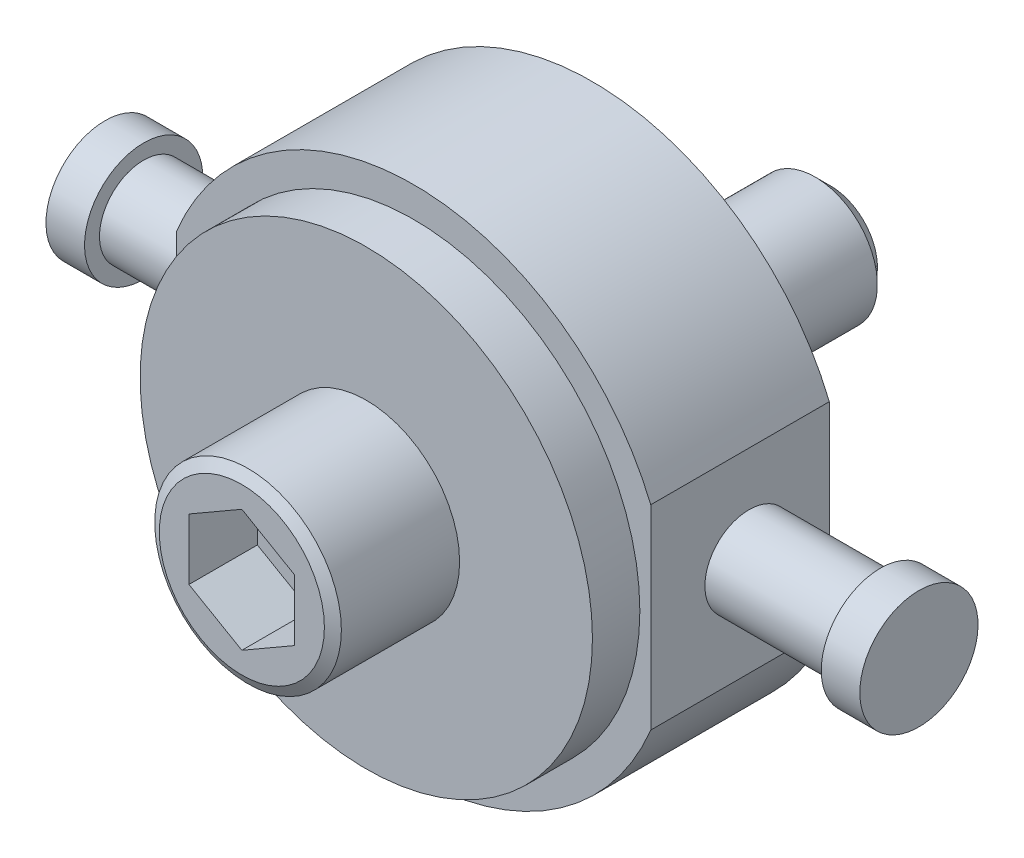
ISO-10303-21;
HEADER;
FILE_DESCRIPTION(('STEP AP214'),'2;1');
FILE_NAME('part.step','',(''),(''),'','','');
FILE_SCHEMA(('AUTOMOTIVE_DESIGN { 1 0 10303 214 1 1 1 1 }'));
ENDSEC;
DATA;
#1=APPLICATION_CONTEXT('core data for automotive mechanical design processes');
#2=APPLICATION_PROTOCOL_DEFINITION('international standard','automotive_design',2000,#1);
#3=PRODUCT_CONTEXT('',#1,'mechanical');
#4=PRODUCT('Part','Part','',(#3));
#5=PRODUCT_RELATED_PRODUCT_CATEGORY('part','',(#4));
#6=PRODUCT_DEFINITION_FORMATION('','',#4);
#7=PRODUCT_DEFINITION_CONTEXT('part definition',#1,'design');
#8=PRODUCT_DEFINITION('design','',#6,#7);
#9=PRODUCT_DEFINITION_SHAPE('','',#8);
#10=(LENGTH_UNIT() NAMED_UNIT(*) SI_UNIT(.MILLI.,.METRE.));
#11=(NAMED_UNIT(*) PLANE_ANGLE_UNIT() SI_UNIT($,.RADIAN.));
#12=(NAMED_UNIT(*) SI_UNIT($,.STERADIAN.) SOLID_ANGLE_UNIT());
#13=UNCERTAINTY_MEASURE_WITH_UNIT(LENGTH_MEASURE(1.E-05),#10,'distance_accuracy_value','');
#14=(GEOMETRIC_REPRESENTATION_CONTEXT(3) GLOBAL_UNCERTAINTY_ASSIGNED_CONTEXT((#13)) GLOBAL_UNIT_ASSIGNED_CONTEXT((#10,
#11,#12)) REPRESENTATION_CONTEXT('',''));
#15=CARTESIAN_POINT('',(0.,0.,0.));
#16=DIRECTION('',(0.,0.,1.));
#17=DIRECTION('',(1.,0.,0.));
#18=AXIS2_PLACEMENT_3D('',#15,#16,#17);
#19=CARTESIAN_POINT('',(0.,0.,0.));
#20=DIRECTION('',(0.,0.,1.));
#21=DIRECTION('',(1.,0.,0.));
#22=AXIS2_PLACEMENT_3D('',#19,#20,#21);
#23=PLANE('',#22);
#24=CARTESIAN_POINT('',(0.,0.,0.));
#25=DIRECTION('',(0.,0.,1.));
#26=DIRECTION('',(1.,0.,0.));
#27=AXIS2_PLACEMENT_3D('',#24,#25,#26);
#28=CIRCLE('',#27,29.3);
#29=CARTESIAN_POINT('',(29.3,0.,0.));
#30=VERTEX_POINT('',#29);
#31=EDGE_CURVE('E110',#30,#30,#28,.T.);
#32=ORIENTED_EDGE('',*,*,#31,.F.);
#33=EDGE_LOOP('',(#32));
#34=FACE_BOUND('',#33,.T.);
#35=CARTESIAN_POINT('',(0.,0.,0.));
#36=DIRECTION('',(0.,0.,-1.));
#37=DIRECTION('',(-1.,0.,0.));
#38=AXIS2_PLACEMENT_3D('',#35,#36,#37);
#39=CIRCLE('',#38,10.);
#40=CARTESIAN_POINT('',(-10.,0.,0.));
#41=VERTEX_POINT('',#40);
#42=EDGE_CURVE('E135',#41,#41,#39,.T.);
#43=ORIENTED_EDGE('',*,*,#42,.F.);
#44=EDGE_LOOP('',(#43));
#45=FACE_BOUND('',#44,.T.);
#46=ADVANCED_FACE('F14',(#34,#45),#23,.F.);
#47=CARTESIAN_POINT('',(59.2,0.,19.22));
#48=DIRECTION('',(1.,0.,0.));
#49=DIRECTION('',(0.,1.,0.));
#50=AXIS2_PLACEMENT_3D('',#47,#48,#49);
#51=PLANE('',#50);
#52=CARTESIAN_POINT('',(59.2,0.,19.22));
#53=DIRECTION('',(1.,0.,0.));
#54=DIRECTION('',(0.,0.,-1.));
#55=AXIS2_PLACEMENT_3D('',#52,#53,#54);
#56=CIRCLE('',#55,7.1);
#57=CARTESIAN_POINT('',(59.2,0.,12.12));
#58=VERTEX_POINT('',#57);
#59=EDGE_CURVE('E128',#58,#58,#56,.F.);
#60=ORIENTED_EDGE('',*,*,#59,.F.);
#61=EDGE_LOOP('',(#60));
#62=FACE_BOUND('',#61,.T.);
#63=CARTESIAN_POINT('',(59.2,0.,19.22));
#64=DIRECTION('',(1.,0.,0.));
#65=DIRECTION('',(0.,1.,0.));
#66=AXIS2_PLACEMENT_3D('',#63,#64,#65);
#67=CIRCLE('',#66,9.5);
#68=CARTESIAN_POINT('',(59.2,9.5,19.22));
#69=VERTEX_POINT('',#68);
#70=EDGE_CURVE('E9',#69,#69,#67,.T.);
#71=ORIENTED_EDGE('',*,*,#70,.F.);
#72=EDGE_LOOP('',(#71));
#73=FACE_BOUND('',#72,.T.);
#74=ADVANCED_FACE('F185',(#62,#73),#51,.F.);
#75=CARTESIAN_POINT('',(-59.2,0.,19.22));
#76=DIRECTION('',(1.,0.,0.));
#77=DIRECTION('',(0.,1.,0.));
#78=AXIS2_PLACEMENT_3D('',#75,#76,#77);
#79=PLANE('',#78);
#80=CARTESIAN_POINT('',(-59.2,0.,19.22));
#81=DIRECTION('',(1.,0.,0.));
#82=DIRECTION('',(0.,0.,-1.));
#83=AXIS2_PLACEMENT_3D('',#80,#81,#82);
#84=CIRCLE('',#83,7.1);
#85=CARTESIAN_POINT('',(-59.2,0.,12.12));
#86=VERTEX_POINT('',#85);
#87=EDGE_CURVE('E113',#86,#86,#84,.T.);
#88=ORIENTED_EDGE('',*,*,#87,.F.);
#89=EDGE_LOOP('',(#88));
#90=FACE_BOUND('',#89,.T.);
#91=CARTESIAN_POINT('',(-59.2,0.,19.22));
#92=DIRECTION('',(1.,0.,0.));
#93=DIRECTION('',(0.,1.,0.));
#94=AXIS2_PLACEMENT_3D('',#91,#92,#93);
#95=CIRCLE('',#94,9.5);
#96=CARTESIAN_POINT('',(-59.2,9.5,19.22));
#97=VERTEX_POINT('',#96);
#98=EDGE_CURVE('E116',#97,#97,#95,.T.);
#99=ORIENTED_EDGE('',*,*,#98,.T.);
#100=EDGE_LOOP('',(#99));
#101=FACE_BOUND('',#100,.T.);
#102=ADVANCED_FACE('F192',(#90,#101),#79,.T.);
#103=CARTESIAN_POINT('',(61.1,0.,19.22));
#104=DIRECTION('',(-1.,0.,0.));
#105=DIRECTION('',(0.,-1.,0.));
#106=AXIS2_PLACEMENT_3D('',#103,#104,#105);
#107=CYLINDRICAL_SURFACE('',#106,7.1);
#108=CARTESIAN_POINT('',(38.1,0.,19.22));
#109=DIRECTION('',(1.,0.,0.));
#110=DIRECTION('',(0.,1.,0.));
#111=AXIS2_PLACEMENT_3D('',#108,#109,#110);
#112=CIRCLE('',#111,7.1);
#113=CARTESIAN_POINT('',(38.1,7.09999999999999,19.22));
#114=VERTEX_POINT('',#113);
#115=EDGE_CURVE('E119',#114,#114,#112,.T.);
#116=ORIENTED_EDGE('',*,*,#115,.T.);
#117=EDGE_LOOP('',(#116));
#118=FACE_BOUND('',#117,.T.);
#119=ORIENTED_EDGE('',*,*,#59,.T.);
#120=EDGE_LOOP('',(#119));
#121=FACE_BOUND('',#120,.T.);
#122=ADVANCED_FACE('F200',(#118,#121),#107,.T.);
#123=CARTESIAN_POINT('',(0.,0.,42.64));
#124=DIRECTION('',(0.,0.,1.));
#125=DIRECTION('',(1.,0.,0.));
#126=AXIS2_PLACEMENT_3D('',#123,#124,#125);
#127=PLANE('',#126);
#128=CARTESIAN_POINT('',(0.,0.,42.64));
#129=DIRECTION('',(0.,0.,1.));
#130=DIRECTION('',(1.,0.,0.));
#131=AXIS2_PLACEMENT_3D('',#128,#129,#130);
#132=CIRCLE('',#131,36.35);
#133=CARTESIAN_POINT('',(36.35,0.,42.64));
#134=VERTEX_POINT('',#133);
#135=EDGE_CURVE('E89',#134,#134,#132,.T.);
#136=ORIENTED_EDGE('',*,*,#135,.T.);
#137=EDGE_LOOP('',(#136));
#138=FACE_BOUND('',#137,.T.);
#139=CARTESIAN_POINT('',(0.,0.,42.64));
#140=DIRECTION('',(0.,0.,1.));
#141=DIRECTION('',(1.,0.,0.));
#142=AXIS2_PLACEMENT_3D('',#139,#140,#141);
#143=CIRCLE('',#142,15.);
#144=CARTESIAN_POINT('',(15.,0.,42.64));
#145=VERTEX_POINT('',#144);
#146=EDGE_CURVE('E138',#145,#145,#143,.T.);
#147=ORIENTED_EDGE('',*,*,#146,.F.);
#148=EDGE_LOOP('',(#147));
#149=FACE_BOUND('',#148,.T.);
#150=ADVANCED_FACE('F253',(#138,#149),#127,.T.);
#151=CARTESIAN_POINT('',(0.,0.,35.02));
#152=DIRECTION('',(0.,0.,1.));
#153=DIRECTION('',(1.,0.,0.));
#154=AXIS2_PLACEMENT_3D('',#151,#152,#153);
#155=PLANE('',#154);
#156=CARTESIAN_POINT('',(0.,0.,35.02));
#157=DIRECTION('',(0.,0.,1.));
#158=DIRECTION('',(1.,0.,0.));
#159=AXIS2_PLACEMENT_3D('',#156,#157,#158);
#160=CIRCLE('',#159,41.2);
#161=CARTESIAN_POINT('',(38.1,15.6789668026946,35.02));
#162=VERTEX_POINT('',#161);
#163=CARTESIAN_POINT('',(-38.1,15.6789668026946,35.02));
#164=VERTEX_POINT('',#163);
#165=EDGE_CURVE('E82',#162,#164,#160,.T.);
#166=ORIENTED_EDGE('',*,*,#165,.T.);
#167=DIRECTION('',(0.,-1.,0.));
#168=VECTOR('',#167,1.);
#169=CARTESIAN_POINT('',(-38.1,15.6789668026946,35.02));
#170=LINE('',#169,#168);
#171=CARTESIAN_POINT('',(-38.1,-15.6789668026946,35.02));
#172=VERTEX_POINT('',#171);
#173=EDGE_CURVE('E88',#164,#172,#170,.T.);
#174=ORIENTED_EDGE('',*,*,#173,.T.);
#175=CARTESIAN_POINT('',(0.,0.,35.02));
#176=DIRECTION('',(0.,0.,1.));
#177=DIRECTION('',(1.,0.,0.));
#178=AXIS2_PLACEMENT_3D('',#175,#176,#177);
#179=CIRCLE('',#178,41.2);
#180=CARTESIAN_POINT('',(38.1,-15.6789668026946,35.02));
#181=VERTEX_POINT('',#180);
#182=EDGE_CURVE('E95',#172,#181,#179,.T.);
#183=ORIENTED_EDGE('',*,*,#182,.T.);
#184=DIRECTION('',(0.,-1.,0.));
#185=VECTOR('',#184,1.);
#186=CARTESIAN_POINT('',(38.1,15.6789668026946,35.02));
#187=LINE('',#186,#185);
#188=EDGE_CURVE('E72',#162,#181,#187,.T.);
#189=ORIENTED_EDGE('',*,*,#188,.F.);
#190=EDGE_LOOP('',(#166,#174,#183,#189));
#191=FACE_BOUND('',#190,.T.);
#192=CARTESIAN_POINT('',(0.,0.,35.02));
#193=DIRECTION('',(0.,0.,1.));
#194=DIRECTION('',(1.,0.,0.));
#195=AXIS2_PLACEMENT_3D('',#192,#193,#194);
#196=CIRCLE('',#195,36.35);
#197=CARTESIAN_POINT('',(36.35,0.,35.02));
#198=VERTEX_POINT('',#197);
#199=EDGE_CURVE('E127',#198,#198,#196,.T.);
#200=ORIENTED_EDGE('',*,*,#199,.F.);
#201=EDGE_LOOP('',(#200));
#202=FACE_BOUND('',#201,.T.);
#203=ADVANCED_FACE('F92',(#191,#202),#155,.T.);
#204=CARTESIAN_POINT('',(38.1,15.6789668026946,35.02));
#205=DIRECTION('',(1.,0.,0.));
#206=DIRECTION('',(0.,1.,0.));
#207=AXIS2_PLACEMENT_3D('',#204,#205,#206);
#208=PLANE('',#207);
#209=ORIENTED_EDGE('',*,*,#188,.T.);
#210=DIRECTION('',(0.,0.,-1.));
#211=VECTOR('',#210,1.);
#212=CARTESIAN_POINT('',(38.1,-15.6789668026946,35.02));
#213=LINE('',#212,#211);
#214=CARTESIAN_POINT('',(38.1,-15.6789668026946,6.32));
#215=VERTEX_POINT('',#214);
#216=EDGE_CURVE('E96',#181,#215,#213,.T.);
#217=ORIENTED_EDGE('',*,*,#216,.T.);
#218=DIRECTION('',(0.,-1.,0.));
#219=VECTOR('',#218,1.);
#220=CARTESIAN_POINT('',(38.1,15.6789668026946,6.32));
#221=LINE('',#220,#219);
#222=CARTESIAN_POINT('',(38.1,15.6789668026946,6.32));
#223=VERTEX_POINT('',#222);
#224=EDGE_CURVE('E74',#223,#215,#221,.T.);
#225=ORIENTED_EDGE('',*,*,#224,.F.);
#226=DIRECTION('',(0.,0.,-1.));
#227=VECTOR('',#226,1.);
#228=CARTESIAN_POINT('',(38.1,15.6789668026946,35.02));
#229=LINE('',#228,#227);
#230=EDGE_CURVE('E67',#162,#223,#229,.T.);
#231=ORIENTED_EDGE('',*,*,#230,.F.);
#232=EDGE_LOOP('',(#209,#217,#225,#231));
#233=FACE_BOUND('',#232,.T.);
#234=ORIENTED_EDGE('',*,*,#115,.F.);
#235=EDGE_LOOP('',(#234));
#236=FACE_BOUND('',#235,.T.);
#237=ADVANCED_FACE('F69',(#233,#236),#208,.T.);
#238=CARTESIAN_POINT('',(0.,0.,6.32));
#239=DIRECTION('',(0.,0.,1.));
#240=DIRECTION('',(1.,0.,0.));
#241=AXIS2_PLACEMENT_3D('',#238,#239,#240);
#242=PLANE('',#241);
#243=CARTESIAN_POINT('',(0.,0.,6.32));
#244=DIRECTION('',(0.,0.,1.));
#245=DIRECTION('',(1.,0.,0.));
#246=AXIS2_PLACEMENT_3D('',#243,#244,#245);
#247=CIRCLE('',#246,41.2);
#248=CARTESIAN_POINT('',(-38.1,15.6789668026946,6.32));
#249=VERTEX_POINT('',#248);
#250=EDGE_CURVE('E78',#223,#249,#247,.T.);
#251=ORIENTED_EDGE('',*,*,#250,.F.);
#252=ORIENTED_EDGE('',*,*,#224,.T.);
#253=CARTESIAN_POINT('',(0.,0.,6.32));
#254=DIRECTION('',(0.,0.,1.));
#255=DIRECTION('',(1.,0.,0.));
#256=AXIS2_PLACEMENT_3D('',#253,#254,#255);
#257=CIRCLE('',#256,41.2);
#258=CARTESIAN_POINT('',(-38.1,-15.6789668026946,6.32));
#259=VERTEX_POINT('',#258);
#260=EDGE_CURVE('E106',#259,#215,#257,.T.);
#261=ORIENTED_EDGE('',*,*,#260,.F.);
#262=DIRECTION('',(0.,-1.,0.));
#263=VECTOR('',#262,1.);
#264=CARTESIAN_POINT('',(-38.1,15.6789668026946,6.32));
#265=LINE('',#264,#263);
#266=EDGE_CURVE('E107',#249,#259,#265,.T.);
#267=ORIENTED_EDGE('',*,*,#266,.F.);
#268=EDGE_LOOP('',(#251,#252,#261,#267));
#269=FACE_BOUND('',#268,.T.);
#270=CARTESIAN_POINT('',(0.,0.,6.32));
#271=DIRECTION('',(0.,0.,1.));
#272=DIRECTION('',(1.,0.,0.));
#273=AXIS2_PLACEMENT_3D('',#270,#271,#272);
#274=CIRCLE('',#273,29.3);
#275=CARTESIAN_POINT('',(29.3,0.,6.32));
#276=VERTEX_POINT('',#275);
#277=EDGE_CURVE('E79',#276,#276,#274,.T.);
#278=ORIENTED_EDGE('',*,*,#277,.T.);
#279=EDGE_LOOP('',(#278));
#280=FACE_BOUND('',#279,.T.);
#281=ADVANCED_FACE('F165',(#269,#280),#242,.F.);
#282=CARTESIAN_POINT('',(0.,0.,35.02));
#283=DIRECTION('',(0.,0.,-1.));
#284=DIRECTION('',(-1.,0.,0.));
#285=AXIS2_PLACEMENT_3D('',#282,#283,#284);
#286=CYLINDRICAL_SURFACE('',#285,41.2);
#287=DIRECTION('',(0.,0.,-1.));
#288=VECTOR('',#287,1.);
#289=CARTESIAN_POINT('',(-38.1,15.6789668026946,35.02));
#290=LINE('',#289,#288);
#291=EDGE_CURVE('E84',#164,#249,#290,.T.);
#292=ORIENTED_EDGE('',*,*,#291,.F.);
#293=ORIENTED_EDGE('',*,*,#165,.F.);
#294=ORIENTED_EDGE('',*,*,#230,.T.);
#295=ORIENTED_EDGE('',*,*,#250,.T.);
#296=EDGE_LOOP('',(#292,#293,#294,#295));
#297=FACE_BOUND('',#296,.T.);
#298=ADVANCED_FACE('F83',(#297),#286,.T.);
#299=CARTESIAN_POINT('',(-38.1,15.6789668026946,35.02));
#300=DIRECTION('',(1.,0.,0.));
#301=DIRECTION('',(0.,1.,0.));
#302=AXIS2_PLACEMENT_3D('',#299,#300,#301);
#303=PLANE('',#302);
#304=CARTESIAN_POINT('',(-38.1,0.,19.22));
#305=DIRECTION('',(1.,0.,0.));
#306=DIRECTION('',(0.,1.,0.));
#307=AXIS2_PLACEMENT_3D('',#304,#305,#306);
#308=CIRCLE('',#307,7.1);
#309=CARTESIAN_POINT('',(-38.1,7.09999999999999,19.22));
#310=VERTEX_POINT('',#309);
#311=EDGE_CURVE('E109',#310,#310,#308,.T.);
#312=ORIENTED_EDGE('',*,*,#311,.T.);
#313=EDGE_LOOP('',(#312));
#314=FACE_BOUND('',#313,.T.);
#315=DIRECTION('',(0.,0.,-1.));
#316=VECTOR('',#315,1.);
#317=CARTESIAN_POINT('',(-38.1,-15.6789668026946,35.02));
#318=LINE('',#317,#316);
#319=EDGE_CURVE('E104',#172,#259,#318,.T.);
#320=ORIENTED_EDGE('',*,*,#319,.F.);
#321=ORIENTED_EDGE('',*,*,#173,.F.);
#322=ORIENTED_EDGE('',*,*,#291,.T.);
#323=ORIENTED_EDGE('',*,*,#266,.T.);
#324=EDGE_LOOP('',(#320,#321,#322,#323));
#325=FACE_BOUND('',#324,.T.);
#326=ADVANCED_FACE('F163',(#314,#325),#303,.F.);
#327=CARTESIAN_POINT('',(0.,0.,35.02));
#328=DIRECTION('',(0.,0.,-1.));
#329=DIRECTION('',(-1.,0.,0.));
#330=AXIS2_PLACEMENT_3D('',#327,#328,#329);
#331=CYLINDRICAL_SURFACE('',#330,41.2);
#332=ORIENTED_EDGE('',*,*,#216,.F.);
#333=ORIENTED_EDGE('',*,*,#182,.F.);
#334=ORIENTED_EDGE('',*,*,#319,.T.);
#335=ORIENTED_EDGE('',*,*,#260,.T.);
#336=EDGE_LOOP('',(#332,#333,#334,#335));
#337=FACE_BOUND('',#336,.T.);
#338=ADVANCED_FACE('F168',(#337),#331,.T.);
#339=CARTESIAN_POINT('',(0.,0.,6.32));
#340=DIRECTION('',(0.,0.,-1.));
#341=DIRECTION('',(-1.,0.,0.));
#342=AXIS2_PLACEMENT_3D('',#339,#340,#341);
#343=CYLINDRICAL_SURFACE('',#342,29.3);
#344=ORIENTED_EDGE('',*,*,#277,.F.);
#345=EDGE_LOOP('',(#344));
#346=FACE_BOUND('',#345,.T.);
#347=ORIENTED_EDGE('',*,*,#31,.T.);
#348=EDGE_LOOP('',(#347));
#349=FACE_BOUND('',#348,.T.);
#350=ADVANCED_FACE('F170',(#346,#349),#343,.T.);
#351=CARTESIAN_POINT('',(-61.1,0.,19.22));
#352=DIRECTION('',(1.,0.,0.));
#353=DIRECTION('',(0.,1.,0.));
#354=AXIS2_PLACEMENT_3D('',#351,#352,#353);
#355=CYLINDRICAL_SURFACE('',#354,7.1);
#356=ORIENTED_EDGE('',*,*,#87,.T.);
#357=EDGE_LOOP('',(#356));
#358=FACE_BOUND('',#357,.T.);
#359=ORIENTED_EDGE('',*,*,#311,.F.);
#360=EDGE_LOOP('',(#359));
#361=FACE_BOUND('',#360,.T.);
#362=ADVANCED_FACE('F178',(#358,#361),#355,.T.);
#363=CARTESIAN_POINT('',(0.,0.,42.64));
#364=DIRECTION('',(0.,0.,-1.));
#365=DIRECTION('',(-1.,0.,0.));
#366=AXIS2_PLACEMENT_3D('',#363,#364,#365);
#367=CYLINDRICAL_SURFACE('',#366,36.35);
#368=ORIENTED_EDGE('',*,*,#135,.F.);
#369=EDGE_LOOP('',(#368));
#370=FACE_BOUND('',#369,.T.);
#371=ORIENTED_EDGE('',*,*,#199,.T.);
#372=EDGE_LOOP('',(#371));
#373=FACE_BOUND('',#372,.T.);
#374=ADVANCED_FACE('F243',(#370,#373),#367,.T.);
#375=CARTESIAN_POINT('',(0.,0.,62.64));
#376=DIRECTION('',(0.,0.,-1.));
#377=DIRECTION('',(-1.,0.,0.));
#378=AXIS2_PLACEMENT_3D('',#375,#376,#377);
#379=CYLINDRICAL_SURFACE('',#378,15.);
#380=CARTESIAN_POINT('',(0.,0.,61.64));
#381=DIRECTION('',(0.,0.,1.));
#382=DIRECTION('',(1.,0.,0.));
#383=AXIS2_PLACEMENT_3D('',#380,#381,#382);
#384=CIRCLE('',#383,15.);
#385=CARTESIAN_POINT('',(15.,0.,61.64));
#386=VERTEX_POINT('',#385);
#387=EDGE_CURVE('E139',#386,#386,#384,.F.);
#388=ORIENTED_EDGE('',*,*,#387,.T.);
#389=EDGE_LOOP('',(#388));
#390=FACE_BOUND('',#389,.T.);
#391=ORIENTED_EDGE('',*,*,#146,.T.);
#392=EDGE_LOOP('',(#391));
#393=FACE_BOUND('',#392,.T.);
#394=ADVANCED_FACE('F233',(#390,#393),#379,.T.);
#395=CARTESIAN_POINT('',(0.,0.,-32.));
#396=DIRECTION('',(0.,0.,1.));
#397=DIRECTION('',(1.,0.,0.));
#398=AXIS2_PLACEMENT_3D('',#395,#396,#397);
#399=CYLINDRICAL_SURFACE('',#398,10.);
#400=CARTESIAN_POINT('',(0.,0.,-29.5));
#401=DIRECTION('',(0.,0.,-1.));
#402=DIRECTION('',(-1.,0.,0.));
#403=AXIS2_PLACEMENT_3D('',#400,#401,#402);
#404=CIRCLE('',#403,10.);
#405=CARTESIAN_POINT('',(-10.,0.,-29.5));
#406=VERTEX_POINT('',#405);
#407=EDGE_CURVE('E136',#406,#406,#404,.F.);
#408=ORIENTED_EDGE('',*,*,#407,.T.);
#409=EDGE_LOOP('',(#408));
#410=FACE_BOUND('',#409,.T.);
#411=ORIENTED_EDGE('',*,*,#42,.T.);
#412=EDGE_LOOP('',(#411));
#413=FACE_BOUND('',#412,.T.);
#414=ADVANCED_FACE('F222',(#410,#413),#399,.T.);
#415=CARTESIAN_POINT('',(0.,0.,-32.));
#416=DIRECTION('',(0.,0.,-1.));
#417=DIRECTION('',(-1.,0.,0.));
#418=AXIS2_PLACEMENT_3D('',#415,#416,#417);
#419=PLANE('',#418);
#420=CARTESIAN_POINT('',(0.,0.,-32.));
#421=DIRECTION('',(0.,0.,-1.));
#422=DIRECTION('',(-1.,0.,0.));
#423=AXIS2_PLACEMENT_3D('',#420,#421,#422);
#424=CIRCLE('',#423,7.5);
#425=CARTESIAN_POINT('',(-7.5,0.,-32.));
#426=VERTEX_POINT('',#425);
#427=EDGE_CURVE('E131',#426,#426,#424,.T.);
#428=ORIENTED_EDGE('',*,*,#427,.T.);
#429=EDGE_LOOP('',(#428));
#430=FACE_BOUND('',#429,.T.);
#431=ADVANCED_FACE('F220',(#430),#419,.T.);
#432=CARTESIAN_POINT('',(0.,0.,-32.));
#433=DIRECTION('',(0.,0.,1.));
#434=DIRECTION('',(1.,0.,0.));
#435=AXIS2_PLACEMENT_3D('',#432,#433,#434);
#436=CONICAL_SURFACE('',#435,7.5,0.785398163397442);
#437=ORIENTED_EDGE('',*,*,#407,.F.);
#438=EDGE_LOOP('',(#437));
#439=FACE_BOUND('',#438,.T.);
#440=ORIENTED_EDGE('',*,*,#427,.F.);
#441=EDGE_LOOP('',(#440));
#442=FACE_BOUND('',#441,.T.);
#443=ADVANCED_FACE('F217',(#439,#442),#436,.T.);
#444=CARTESIAN_POINT('',(0.,9.81495457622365,51.64));
#445=DIRECTION('',(0.,0.,1.));
#446=DIRECTION('',(1.,0.,0.));
#447=AXIS2_PLACEMENT_3D('',#444,#445,#446);
#448=PLANE('',#447);
#449=DIRECTION('',(-0.866025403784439,0.5,0.));
#450=VECTOR('',#449,1.);
#451=CARTESIAN_POINT('',(8.5,4.90747728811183,51.64));
#452=LINE('',#451,#450);
#453=CARTESIAN_POINT('',(8.5,4.90747728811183,51.64));
#454=VERTEX_POINT('',#453);
#455=CARTESIAN_POINT('',(0.,9.81495457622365,51.64));
#456=VERTEX_POINT('',#455);
#457=EDGE_CURVE('E134',#454,#456,#452,.T.);
#458=ORIENTED_EDGE('',*,*,#457,.T.);
#459=DIRECTION('',(-0.866025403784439,-0.5,0.));
#460=VECTOR('',#459,1.);
#461=CARTESIAN_POINT('',(0.,9.81495457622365,51.64));
#462=LINE('',#461,#460);
#463=CARTESIAN_POINT('',(-8.5,4.90747728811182,51.64));
#464=VERTEX_POINT('',#463);
#465=EDGE_CURVE('E551',#456,#464,#462,.T.);
#466=ORIENTED_EDGE('',*,*,#465,.T.);
#467=DIRECTION('',(0.,-1.,0.));
#468=VECTOR('',#467,1.);
#469=CARTESIAN_POINT('',(-8.5,4.90747728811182,51.64));
#470=LINE('',#469,#468);
#471=CARTESIAN_POINT('',(-8.5,-4.90747728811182,51.64));
#472=VERTEX_POINT('',#471);
#473=EDGE_CURVE('E533',#464,#472,#470,.T.);
#474=ORIENTED_EDGE('',*,*,#473,.T.);
#475=DIRECTION('',(0.866025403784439,-0.5,0.));
#476=VECTOR('',#475,1.);
#477=CARTESIAN_POINT('',(-8.5,-4.90747728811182,51.64));
#478=LINE('',#477,#476);
#479=CARTESIAN_POINT('',(0.,-9.81495457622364,51.64));
#480=VERTEX_POINT('',#479);
#481=EDGE_CURVE('E529',#472,#480,#478,.T.);
#482=ORIENTED_EDGE('',*,*,#481,.T.);
#483=DIRECTION('',(0.866025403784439,0.5,0.));
#484=VECTOR('',#483,1.);
#485=CARTESIAN_POINT('',(0.,-9.81495457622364,51.64));
#486=LINE('',#485,#484);
#487=CARTESIAN_POINT('',(8.5,-4.90747728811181,51.64));
#488=VERTEX_POINT('',#487);
#489=EDGE_CURVE('E545',#480,#488,#486,.T.);
#490=ORIENTED_EDGE('',*,*,#489,.T.);
#491=DIRECTION('',(0.,1.,0.));
#492=VECTOR('',#491,1.);
#493=CARTESIAN_POINT('',(8.5,-4.90747728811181,51.64));
#494=LINE('',#493,#492);
#495=EDGE_CURVE('E492',#488,#454,#494,.T.);
#496=ORIENTED_EDGE('',*,*,#495,.T.);
#497=EDGE_LOOP('',(#458,#466,#474,#482,#490,#496));
#498=FACE_BOUND('',#497,.T.);
#499=ADVANCED_FACE('F219',(#498),#448,.T.);
#500=CARTESIAN_POINT('',(0.,9.81495457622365,51.64));
#501=DIRECTION('',(-0.5,0.866025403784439,0.));
#502=DIRECTION('',(-0.866025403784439,-0.5,0.));
#503=AXIS2_PLACEMENT_3D('',#500,#501,#502);
#504=PLANE('',#503);
#505=DIRECTION('',(-0.866025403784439,-0.5,0.));
#506=VECTOR('',#505,1.);
#507=CARTESIAN_POINT('',(0.,9.81495457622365,62.64));
#508=LINE('',#507,#506);
#509=CARTESIAN_POINT('',(0.,9.81495457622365,62.64));
#510=VERTEX_POINT('',#509);
#511=CARTESIAN_POINT('',(-8.5,4.90747728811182,62.64));
#512=VERTEX_POINT('',#511);
#513=EDGE_CURVE('E480',#510,#512,#508,.T.);
#514=ORIENTED_EDGE('',*,*,#513,.T.);
#515=DIRECTION('',(0.,0.,1.));
#516=VECTOR('',#515,1.);
#517=CARTESIAN_POINT('',(-8.5,4.90747728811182,51.64));
#518=LINE('',#517,#516);
#519=EDGE_CURVE('E484',#464,#512,#518,.T.);
#520=ORIENTED_EDGE('',*,*,#519,.F.);
#521=ORIENTED_EDGE('',*,*,#465,.F.);
#522=DIRECTION('',(0.,0.,1.));
#523=VECTOR('',#522,1.);
#524=CARTESIAN_POINT('',(0.,9.81495457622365,51.64));
#525=LINE('',#524,#523);
#526=EDGE_CURVE('E486',#456,#510,#525,.T.);
#527=ORIENTED_EDGE('',*,*,#526,.T.);
#528=EDGE_LOOP('',(#514,#520,#521,#527));
#529=FACE_BOUND('',#528,.T.);
#530=ADVANCED_FACE('F228',(#529),#504,.F.);
#531=CARTESIAN_POINT('',(-8.5,4.90747728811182,51.64));
#532=DIRECTION('',(-1.,0.,0.));
#533=DIRECTION('',(0.,-1.,0.));
#534=AXIS2_PLACEMENT_3D('',#531,#532,#533);
#535=PLANE('',#534);
#536=DIRECTION('',(0.,-1.,0.));
#537=VECTOR('',#536,1.);
#538=CARTESIAN_POINT('',(-8.5,4.90747728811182,62.64));
#539=LINE('',#538,#537);
#540=CARTESIAN_POINT('',(-8.5,-4.90747728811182,62.64));
#541=VERTEX_POINT('',#540);
#542=EDGE_CURVE('E496',#512,#541,#539,.T.);
#543=ORIENTED_EDGE('',*,*,#542,.T.);
#544=DIRECTION('',(0.,0.,1.));
#545=VECTOR('',#544,1.);
#546=CARTESIAN_POINT('',(-8.5,-4.90747728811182,51.64));
#547=LINE('',#546,#545);
#548=EDGE_CURVE('E508',#472,#541,#547,.T.);
#549=ORIENTED_EDGE('',*,*,#548,.F.);
#550=ORIENTED_EDGE('',*,*,#473,.F.);
#551=ORIENTED_EDGE('',*,*,#519,.T.);
#552=EDGE_LOOP('',(#543,#549,#550,#551));
#553=FACE_BOUND('',#552,.T.);
#554=ADVANCED_FACE('F455',(#553),#535,.F.);
#555=CARTESIAN_POINT('',(-8.5,-4.90747728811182,51.64));
#556=DIRECTION('',(-0.5,-0.866025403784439,0.));
#557=DIRECTION('',(0.866025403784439,-0.5,0.));
#558=AXIS2_PLACEMENT_3D('',#555,#556,#557);
#559=PLANE('',#558);
#560=DIRECTION('',(0.866025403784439,-0.5,0.));
#561=VECTOR('',#560,1.);
#562=CARTESIAN_POINT('',(-8.5,-4.90747728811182,62.64));
#563=LINE('',#562,#561);
#564=CARTESIAN_POINT('',(0.,-9.81495457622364,62.64));
#565=VERTEX_POINT('',#564);
#566=EDGE_CURVE('E500',#541,#565,#563,.T.);
#567=ORIENTED_EDGE('',*,*,#566,.T.);
#568=DIRECTION('',(0.,0.,1.));
#569=VECTOR('',#568,1.);
#570=CARTESIAN_POINT('',(0.,-9.81495457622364,51.64));
#571=LINE('',#570,#569);
#572=EDGE_CURVE('E512',#480,#565,#571,.T.);
#573=ORIENTED_EDGE('',*,*,#572,.F.);
#574=ORIENTED_EDGE('',*,*,#481,.F.);
#575=ORIENTED_EDGE('',*,*,#548,.T.);
#576=EDGE_LOOP('',(#567,#573,#574,#575));
#577=FACE_BOUND('',#576,.T.);
#578=ADVANCED_FACE('F445',(#577),#559,.F.);
#579=CARTESIAN_POINT('',(0.,-9.81495457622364,51.64));
#580=DIRECTION('',(0.5,-0.866025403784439,0.));
#581=DIRECTION('',(0.866025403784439,0.5,0.));
#582=AXIS2_PLACEMENT_3D('',#579,#580,#581);
#583=PLANE('',#582);
#584=DIRECTION('',(0.866025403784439,0.5,0.));
#585=VECTOR('',#584,1.);
#586=CARTESIAN_POINT('',(0.,-9.81495457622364,62.64));
#587=LINE('',#586,#585);
#588=CARTESIAN_POINT('',(8.5,-4.90747728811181,62.64));
#589=VERTEX_POINT('',#588);
#590=EDGE_CURVE('E509',#565,#589,#587,.T.);
#591=ORIENTED_EDGE('',*,*,#590,.T.);
#592=DIRECTION('',(0.,0.,1.));
#593=VECTOR('',#592,1.);
#594=CARTESIAN_POINT('',(8.5,-4.90747728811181,51.64));
#595=LINE('',#594,#593);
#596=EDGE_CURVE('E515',#488,#589,#595,.T.);
#597=ORIENTED_EDGE('',*,*,#596,.F.);
#598=ORIENTED_EDGE('',*,*,#489,.F.);
#599=ORIENTED_EDGE('',*,*,#572,.T.);
#600=EDGE_LOOP('',(#591,#597,#598,#599));
#601=FACE_BOUND('',#600,.T.);
#602=ADVANCED_FACE('F435',(#601),#583,.F.);
#603=CARTESIAN_POINT('',(8.5,-4.90747728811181,51.64));
#604=DIRECTION('',(1.,0.,0.));
#605=DIRECTION('',(0.,0.,-1.));
#606=AXIS2_PLACEMENT_3D('',#603,#604,#605);
#607=PLANE('',#606);
#608=DIRECTION('',(0.,1.,0.));
#609=VECTOR('',#608,1.);
#610=CARTESIAN_POINT('',(8.5,-4.90747728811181,62.64));
#611=LINE('',#610,#609);
#612=CARTESIAN_POINT('',(8.5,4.90747728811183,62.64));
#613=VERTEX_POINT('',#612);
#614=EDGE_CURVE('E513',#589,#613,#611,.T.);
#615=ORIENTED_EDGE('',*,*,#614,.T.);
#616=DIRECTION('',(0.,0.,1.));
#617=VECTOR('',#616,1.);
#618=CARTESIAN_POINT('',(8.5,4.90747728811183,51.64));
#619=LINE('',#618,#617);
#620=EDGE_CURVE('E33',#454,#613,#619,.T.);
#621=ORIENTED_EDGE('',*,*,#620,.F.);
#622=ORIENTED_EDGE('',*,*,#495,.F.);
#623=ORIENTED_EDGE('',*,*,#596,.T.);
#624=EDGE_LOOP('',(#615,#621,#622,#623));
#625=FACE_BOUND('',#624,.T.);
#626=ADVANCED_FACE('F430',(#625),#607,.F.);
#627=CARTESIAN_POINT('',(8.5,4.90747728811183,51.64));
#628=DIRECTION('',(0.5,0.866025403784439,0.));
#629=DIRECTION('',(-0.866025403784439,0.5,0.));
#630=AXIS2_PLACEMENT_3D('',#627,#628,#629);
#631=PLANE('',#630);
#632=DIRECTION('',(-0.866025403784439,0.5,0.));
#633=VECTOR('',#632,1.);
#634=CARTESIAN_POINT('',(8.5,4.90747728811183,62.64));
#635=LINE('',#634,#633);
#636=EDGE_CURVE('E517',#613,#510,#635,.T.);
#637=ORIENTED_EDGE('',*,*,#636,.T.);
#638=ORIENTED_EDGE('',*,*,#526,.F.);
#639=ORIENTED_EDGE('',*,*,#457,.F.);
#640=ORIENTED_EDGE('',*,*,#620,.T.);
#641=EDGE_LOOP('',(#637,#638,#639,#640));
#642=FACE_BOUND('',#641,.T.);
#643=ADVANCED_FACE('F250',(#642),#631,.F.);
#644=CARTESIAN_POINT('',(0.,0.,62.64));
#645=DIRECTION('',(0.,0.,1.));
#646=DIRECTION('',(1.,0.,0.));
#647=AXIS2_PLACEMENT_3D('',#644,#645,#646);
#648=PLANE('',#647);
#649=CARTESIAN_POINT('',(0.,0.,62.64));
#650=DIRECTION('',(0.,0.,1.));
#651=DIRECTION('',(1.,0.,0.));
#652=AXIS2_PLACEMENT_3D('',#649,#650,#651);
#653=CIRCLE('',#652,13.2679491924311);
#654=CARTESIAN_POINT('',(13.2679491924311,0.,62.64));
#655=VERTEX_POINT('',#654);
#656=EDGE_CURVE('E18',#655,#655,#653,.T.);
#657=ORIENTED_EDGE('',*,*,#656,.T.);
#658=EDGE_LOOP('',(#657));
#659=FACE_BOUND('',#658,.T.);
#660=ORIENTED_EDGE('',*,*,#636,.F.);
#661=ORIENTED_EDGE('',*,*,#614,.F.);
#662=ORIENTED_EDGE('',*,*,#590,.F.);
#663=ORIENTED_EDGE('',*,*,#566,.F.);
#664=ORIENTED_EDGE('',*,*,#542,.F.);
#665=ORIENTED_EDGE('',*,*,#513,.F.);
#666=EDGE_LOOP('',(#660,#661,#662,#663,#664,#665));
#667=FACE_BOUND('',#666,.T.);
#668=ADVANCED_FACE('F248',(#659,#667),#648,.T.);
#669=CARTESIAN_POINT('',(0.,0.,61.64));
#670=DIRECTION('',(0.,0.,-1.));
#671=DIRECTION('',(-1.,0.,0.));
#672=AXIS2_PLACEMENT_3D('',#669,#670,#671);
#673=CONICAL_SURFACE('',#672,15.,1.0471975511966);
#674=ORIENTED_EDGE('',*,*,#656,.F.);
#675=EDGE_LOOP('',(#674));
#676=FACE_BOUND('',#675,.T.);
#677=ORIENTED_EDGE('',*,*,#387,.F.);
#678=EDGE_LOOP('',(#677));
#679=FACE_BOUND('',#678,.T.);
#680=ADVANCED_FACE('F16',(#676,#679),#673,.T.);
#681=CARTESIAN_POINT('',(-65.4,0.,19.22));
#682=DIRECTION('',(1.,0.,0.));
#683=DIRECTION('',(0.,1.,0.));
#684=AXIS2_PLACEMENT_3D('',#681,#682,#683);
#685=PLANE('',#684);
#686=CARTESIAN_POINT('',(-65.4,0.,19.22));
#687=DIRECTION('',(1.,0.,0.));
#688=DIRECTION('',(0.,1.,0.));
#689=AXIS2_PLACEMENT_3D('',#686,#687,#688);
#690=CIRCLE('',#689,9.5);
#691=CARTESIAN_POINT('',(-65.4,9.5,19.22));
#692=VERTEX_POINT('',#691);
#693=EDGE_CURVE('E120',#692,#692,#690,.T.);
#694=ORIENTED_EDGE('',*,*,#693,.F.);
#695=EDGE_LOOP('',(#694));
#696=FACE_BOUND('',#695,.T.);
#697=ADVANCED_FACE('F202',(#696),#685,.F.);
#698=CARTESIAN_POINT('',(-65.4,0.,19.22));
#699=DIRECTION('',(1.,0.,0.));
#700=DIRECTION('',(0.,1.,0.));
#701=AXIS2_PLACEMENT_3D('',#698,#699,#700);
#702=CYLINDRICAL_SURFACE('',#701,9.5);
#703=ORIENTED_EDGE('',*,*,#693,.T.);
#704=EDGE_LOOP('',(#703));
#705=FACE_BOUND('',#704,.T.);
#706=ORIENTED_EDGE('',*,*,#98,.F.);
#707=EDGE_LOOP('',(#706));
#708=FACE_BOUND('',#707,.T.);
#709=ADVANCED_FACE('F205',(#705,#708),#702,.T.);
#710=CARTESIAN_POINT('',(65.4,0.,19.22));
#711=DIRECTION('',(1.,0.,0.));
#712=DIRECTION('',(0.,1.,0.));
#713=AXIS2_PLACEMENT_3D('',#710,#711,#712);
#714=PLANE('',#713);
#715=CARTESIAN_POINT('',(65.4,0.,19.22));
#716=DIRECTION('',(1.,0.,0.));
#717=DIRECTION('',(0.,1.,0.));
#718=AXIS2_PLACEMENT_3D('',#715,#716,#717);
#719=CIRCLE('',#718,9.5);
#720=CARTESIAN_POINT('',(65.4,9.5,19.22));
#721=VERTEX_POINT('',#720);
#722=EDGE_CURVE('E24',#721,#721,#719,.T.);
#723=ORIENTED_EDGE('',*,*,#722,.T.);
#724=EDGE_LOOP('',(#723));
#725=FACE_BOUND('',#724,.T.);
#726=ADVANCED_FACE('F208',(#725),#714,.T.);
#727=CARTESIAN_POINT('',(65.4,0.,19.22));
#728=DIRECTION('',(-1.,0.,0.));
#729=DIRECTION('',(0.,-1.,0.));
#730=AXIS2_PLACEMENT_3D('',#727,#728,#729);
#731=CYLINDRICAL_SURFACE('',#730,9.5);
#732=ORIENTED_EDGE('',*,*,#722,.F.);
#733=EDGE_LOOP('',(#732));
#734=FACE_BOUND('',#733,.T.);
#735=ORIENTED_EDGE('',*,*,#70,.T.);
#736=EDGE_LOOP('',(#735));
#737=FACE_BOUND('',#736,.T.);
#738=ADVANCED_FACE('F213',(#734,#737),#731,.T.);
#739=CLOSED_SHELL('',(#46,#74,#102,#122,#150,#203,#237,#281,#298,#326,#338,#350,#362,#374,#394,
#414,#431,#443,#499,#530,#554,#578,#602,#626,#643,#668,#680,#697,#709,#726,#738));
#740=MANIFOLD_SOLID_BREP('B1',#739);
#741=ADVANCED_BREP_SHAPE_REPRESENTATION('',(#18,#740),#14);
#742=SHAPE_DEFINITION_REPRESENTATION(#9,#741);
ENDSEC;
END-ISO-10303-21;
